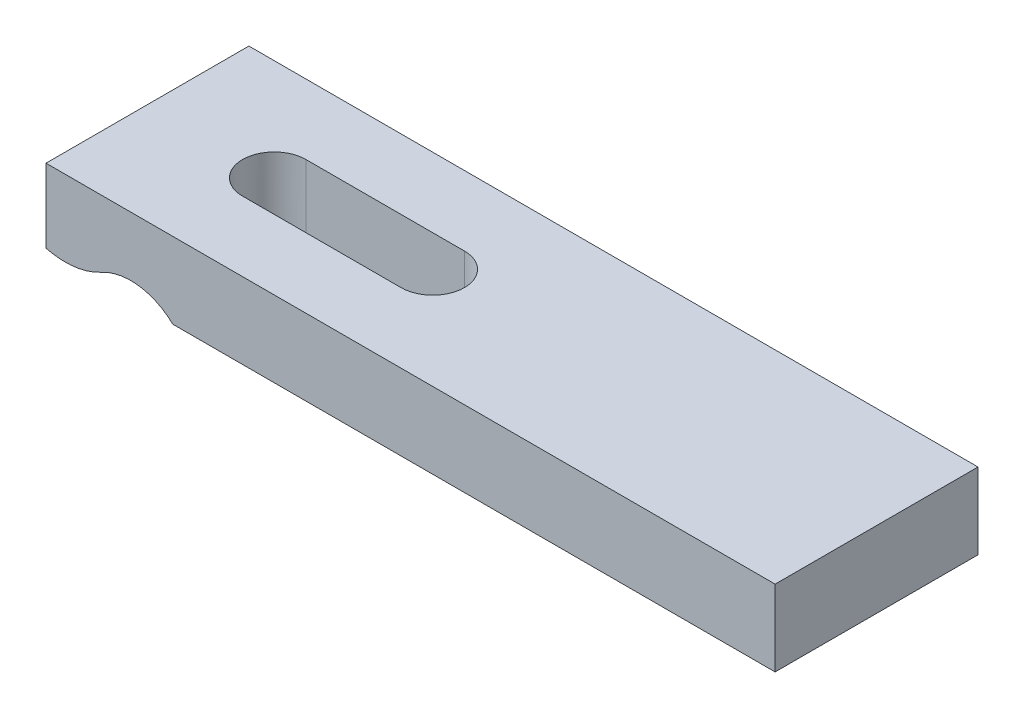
from build123d import *

# Parameters (mm, degrees)
BASE_EXTRUSION_DEPTH    = 32
ENL_V_MAT_EXTRU_1_DEPTH = 120.970829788


with BuildPart() as part:
    # Esquisse1 → Base-Extrusion (new body)
    with BuildSketch(Plane.XY):
        with BuildLine():
            Line((0, 0), (115, 0))
            Line((115, 0), (115, -12))
            Line((115, -12), (19.996369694, -12))
            ThreePointArc((19.996369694, -12), (14.619647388, -9.428865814), (8.761701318, -10.526290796))
            ThreePointArc((8.761701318, -10.526290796), (4.484999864, -11.907761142), (0, -11.618950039))
            Line((0, -11.618950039), (0, 0))
        make_face()
    extrude(amount=BASE_EXTRUSION_DEPTH)

    # Esquisse2 → Enl_v. mat.-Extru.1 (cut, through all)
    with BuildSketch(Plane(origin=(0, 0, 0), x_dir=(1, 0, 0), z_dir=(0, 1, 0))):
        with BuildLine():
            Line((20, -11), (45, -11))
            ThreePointArc((45, -11), (50, -16), (45, -21))
            Line((45, -21), (20, -21))
            ThreePointArc((20, -21), (15, -16), (20, -11))
        make_face()
    extrude(amount=-ENL_V_MAT_EXTRU_1_DEPTH, mode=Mode.SUBTRACT)


solid = part.part
